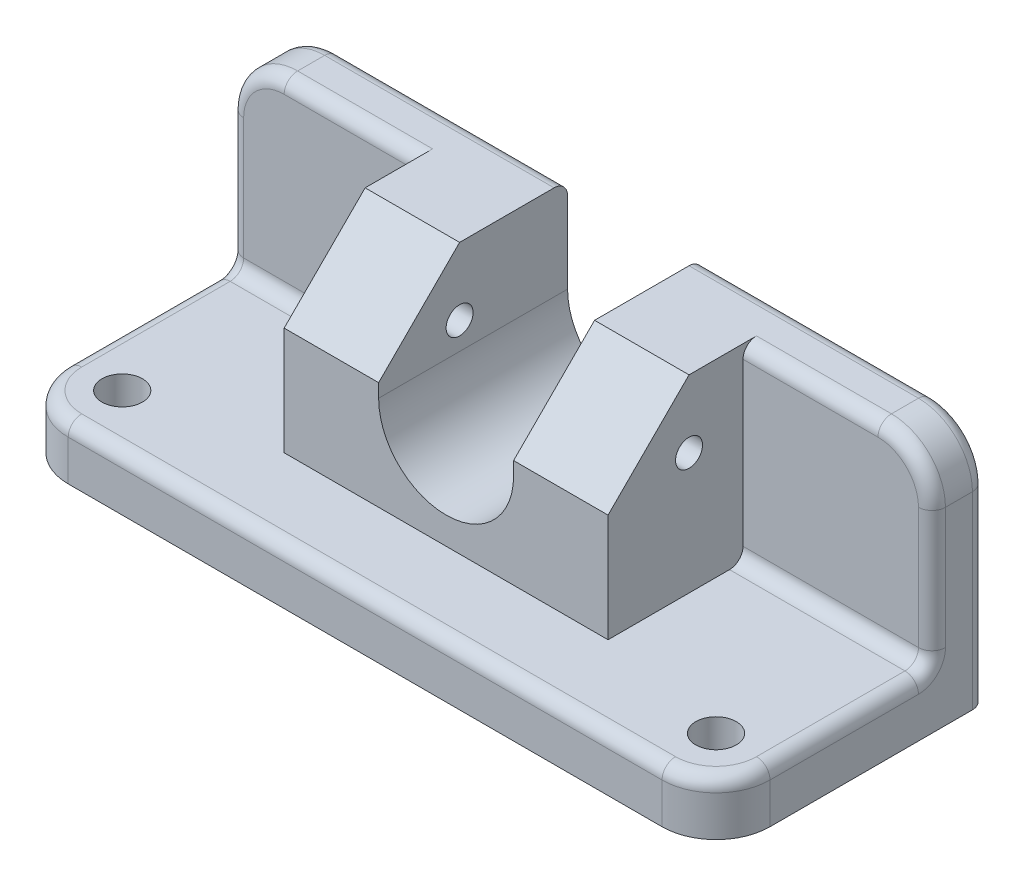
ISO-10303-21;
HEADER;
FILE_DESCRIPTION(('STEP AP214'),'2;1');
FILE_NAME('part.step','',(''),(''),'','','');
FILE_SCHEMA(('AUTOMOTIVE_DESIGN { 1 0 10303 214 1 1 1 1 }'));
ENDSEC;
DATA;
#1=APPLICATION_CONTEXT('core data for automotive mechanical design processes');
#2=APPLICATION_PROTOCOL_DEFINITION('international standard','automotive_design',2000,#1);
#3=PRODUCT_CONTEXT('',#1,'mechanical');
#4=PRODUCT('Part','Part','',(#3));
#5=PRODUCT_RELATED_PRODUCT_CATEGORY('part','',(#4));
#6=PRODUCT_DEFINITION_FORMATION('','',#4);
#7=PRODUCT_DEFINITION_CONTEXT('part definition',#1,'design');
#8=PRODUCT_DEFINITION('design','',#6,#7);
#9=PRODUCT_DEFINITION_SHAPE('','',#8);
#10=(LENGTH_UNIT() NAMED_UNIT(*) SI_UNIT(.MILLI.,.METRE.));
#11=(NAMED_UNIT(*) PLANE_ANGLE_UNIT() SI_UNIT($,.RADIAN.));
#12=(NAMED_UNIT(*) SI_UNIT($,.STERADIAN.) SOLID_ANGLE_UNIT());
#13=UNCERTAINTY_MEASURE_WITH_UNIT(LENGTH_MEASURE(1.E-05),#10,'distance_accuracy_value','');
#14=(GEOMETRIC_REPRESENTATION_CONTEXT(3) GLOBAL_UNCERTAINTY_ASSIGNED_CONTEXT((#13)) GLOBAL_UNIT_ASSIGNED_CONTEXT((#10,
#11,#12)) REPRESENTATION_CONTEXT('',''));
#15=CARTESIAN_POINT('',(0.,0.,0.));
#16=DIRECTION('',(0.,0.,1.));
#17=DIRECTION('',(1.,0.,0.));
#18=AXIS2_PLACEMENT_3D('',#15,#16,#17);
#19=CARTESIAN_POINT('',(0.,20.,0.));
#20=DIRECTION('',(0.,-1.,0.));
#21=DIRECTION('',(0.,0.,-1.));
#22=AXIS2_PLACEMENT_3D('',#19,#20,#21);
#23=PLANE('',#22);
#24=CARTESIAN_POINT('',(-44.9999999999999,20.,30.));
#25=DIRECTION('',(0.,1.,0.));
#26=DIRECTION('',(0.,0.,1.));
#27=AXIS2_PLACEMENT_3D('',#24,#25,#26);
#28=CIRCLE('',#27,7.49999999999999);
#29=CARTESIAN_POINT('',(-44.9999999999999,20.,37.5));
#30=VERTEX_POINT('',#29);
#31=EDGE_CURVE('E414',#30,#30,#28,.T.);
#32=ORIENTED_EDGE('',*,*,#31,.F.);
#33=EDGE_LOOP('',(#32));
#34=FACE_BOUND('',#33,.T.);
#35=DIRECTION('',(0.,0.,-1.));
#36=VECTOR('',#35,1.);
#37=CARTESIAN_POINT('',(4.99999999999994,20.,20.));
#38=LINE('',#37,#36);
#39=CARTESIAN_POINT('',(4.99999999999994,20.,20.));
#40=VERTEX_POINT('',#39);
#41=CARTESIAN_POINT('',(4.99999999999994,20.,-25.));
#42=VERTEX_POINT('',#41);
#43=EDGE_CURVE('E437',#40,#42,#38,.T.);
#44=ORIENTED_EDGE('',*,*,#43,.T.);
#45=DIRECTION('',(1.,0.,0.));
#46=VECTOR('',#45,1.);
#47=CARTESIAN_POINT('',(-64.9999999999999,20.,-25.));
#48=LINE('',#47,#46);
#49=CARTESIAN_POINT('',(-59.9999999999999,20.,-25.));
#50=VERTEX_POINT('',#49);
#51=EDGE_CURVE('E493',#42,#50,#48,.F.);
#52=ORIENTED_EDGE('',*,*,#51,.T.);
#53=DIRECTION('',(0.,0.,1.));
#54=VECTOR('',#53,1.);
#55=CARTESIAN_POINT('',(-59.9999999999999,20.,0.));
#56=LINE('',#55,#54);
#57=CARTESIAN_POINT('',(-59.9999999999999,20.,30.));
#58=VERTEX_POINT('',#57);
#59=EDGE_CURVE('E491',#50,#58,#56,.T.);
#60=ORIENTED_EDGE('',*,*,#59,.T.);
#61=CARTESIAN_POINT('',(-44.9999999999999,20.,30.));
#62=DIRECTION('',(0.,-1.,0.));
#63=DIRECTION('',(0.,0.,-1.));
#64=AXIS2_PLACEMENT_3D('',#61,#62,#63);
#65=CIRCLE('',#64,15.);
#66=CARTESIAN_POINT('',(-44.9999999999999,20.,45.));
#67=VERTEX_POINT('',#66);
#68=EDGE_CURVE('E489',#58,#67,#65,.F.);
#69=ORIENTED_EDGE('',*,*,#68,.T.);
#70=DIRECTION('',(1.,0.,0.));
#71=VECTOR('',#70,1.);
#72=CARTESIAN_POINT('',(0.,20.,45.));
#73=LINE('',#72,#71);
#74=CARTESIAN_POINT('',(175.,20.,45.));
#75=VERTEX_POINT('',#74);
#76=EDGE_CURVE('E487',#67,#75,#73,.T.);
#77=ORIENTED_EDGE('',*,*,#76,.T.);
#78=CARTESIAN_POINT('',(175.,20.,30.));
#79=DIRECTION('',(0.,1.,0.));
#80=DIRECTION('',(0.,0.,-1.));
#81=AXIS2_PLACEMENT_3D('',#78,#79,#80);
#82=CIRCLE('',#81,15.);
#83=CARTESIAN_POINT('',(190.,20.,30.));
#84=VERTEX_POINT('',#83);
#85=EDGE_CURVE('E342',#84,#75,#82,.F.);
#86=ORIENTED_EDGE('',*,*,#85,.F.);
#87=DIRECTION('',(0.,0.,1.));
#88=VECTOR('',#87,1.);
#89=CARTESIAN_POINT('',(190.,20.,0.));
#90=LINE('',#89,#88);
#91=CARTESIAN_POINT('',(190.,20.,-25.));
#92=VERTEX_POINT('',#91);
#93=EDGE_CURVE('E345',#92,#84,#90,.T.);
#94=ORIENTED_EDGE('',*,*,#93,.F.);
#95=DIRECTION('',(-1.,0.,0.));
#96=VECTOR('',#95,1.);
#97=CARTESIAN_POINT('',(195.,20.,-25.));
#98=LINE('',#97,#96);
#99=CARTESIAN_POINT('',(125.,20.,-25.));
#100=VERTEX_POINT('',#99);
#101=EDGE_CURVE('E348',#100,#92,#98,.F.);
#102=ORIENTED_EDGE('',*,*,#101,.F.);
#103=DIRECTION('',(0.,0.,-1.));
#104=VECTOR('',#103,1.);
#105=CARTESIAN_POINT('',(125.,20.,20.));
#106=LINE('',#105,#104);
#107=CARTESIAN_POINT('',(125.,20.,20.));
#108=VERTEX_POINT('',#107);
#109=EDGE_CURVE('E292',#108,#100,#106,.T.);
#110=ORIENTED_EDGE('',*,*,#109,.F.);
#111=DIRECTION('',(1.,0.,0.));
#112=VECTOR('',#111,1.);
#113=CARTESIAN_POINT('',(64.9999999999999,20.,20.));
#114=LINE('',#113,#112);
#115=EDGE_CURVE('E435',#40,#108,#114,.T.);
#116=ORIENTED_EDGE('',*,*,#115,.F.);
#117=EDGE_LOOP('',(#44,#52,#60,#69,#77,#86,#94,#102,#110,#116));
#118=FACE_BOUND('',#117,.T.);
#119=CARTESIAN_POINT('',(175.,20.,30.));
#120=DIRECTION('',(0.,-1.,0.));
#121=DIRECTION('',(0.,0.,1.));
#122=AXIS2_PLACEMENT_3D('',#119,#120,#121);
#123=CIRCLE('',#122,7.49999999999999);
#124=CARTESIAN_POINT('',(175.,20.,37.5));
#125=VERTEX_POINT('',#124);
#126=EDGE_CURVE('E410',#125,#125,#123,.T.);
#127=ORIENTED_EDGE('',*,*,#126,.T.);
#128=EDGE_LOOP('',(#127));
#129=FACE_BOUND('',#128,.T.);
#130=ADVANCED_FACE('F34',(#34,#118,#129),#23,.F.);
#131=CARTESIAN_POINT('',(-64.9999999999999,90.,-30.));
#132=DIRECTION('',(0.,0.,-1.));
#133=DIRECTION('',(-1.,0.,0.));
#134=AXIS2_PLACEMENT_3D('',#131,#132,#133);
#135=PLANE('',#134);
#136=DIRECTION('',(0.,-1.,0.));
#137=VECTOR('',#136,1.);
#138=CARTESIAN_POINT('',(-59.9999999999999,90.,-30.));
#139=LINE('',#138,#137);
#140=CARTESIAN_POINT('',(-59.9999999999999,70.,-30.));
#141=VERTEX_POINT('',#140);
#142=CARTESIAN_POINT('',(-59.9999999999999,25.,-30.));
#143=VERTEX_POINT('',#142);
#144=EDGE_CURVE('E480',#141,#143,#139,.T.);
#145=ORIENTED_EDGE('',*,*,#144,.T.);
#146=DIRECTION('',(1.,0.,0.));
#147=VECTOR('',#146,1.);
#148=CARTESIAN_POINT('',(4.99999999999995,25.,-30.));
#149=LINE('',#148,#147);
#150=CARTESIAN_POINT('',(4.99999999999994,25.,-30.));
#151=VERTEX_POINT('',#150);
#152=EDGE_CURVE('E482',#143,#151,#149,.T.);
#153=ORIENTED_EDGE('',*,*,#152,.T.);
#154=DIRECTION('',(0.,-1.,0.));
#155=VECTOR('',#154,1.);
#156=CARTESIAN_POINT('',(4.99999999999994,20.,-30.));
#157=LINE('',#156,#155);
#158=CARTESIAN_POINT('',(4.99999999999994,85.,-30.));
#159=VERTEX_POINT('',#158);
#160=EDGE_CURVE('E431',#159,#151,#157,.T.);
#161=ORIENTED_EDGE('',*,*,#160,.F.);
#162=DIRECTION('',(1.,0.,0.));
#163=VECTOR('',#162,1.);
#164=CARTESIAN_POINT('',(-44.9999999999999,85.,-30.));
#165=LINE('',#164,#163);
#166=CARTESIAN_POINT('',(-44.9999999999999,85.,-30.));
#167=VERTEX_POINT('',#166);
#168=EDGE_CURVE('E478',#159,#167,#165,.F.);
#169=ORIENTED_EDGE('',*,*,#168,.T.);
#170=CARTESIAN_POINT('',(-44.9999999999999,70.,-30.));
#171=DIRECTION('',(0.,0.,-1.));
#172=DIRECTION('',(-1.,0.,0.));
#173=AXIS2_PLACEMENT_3D('',#170,#171,#172);
#174=CIRCLE('',#173,15.);
#175=EDGE_CURVE('E474',#167,#141,#174,.F.);
#176=ORIENTED_EDGE('',*,*,#175,.T.);
#177=EDGE_LOOP('',(#145,#153,#161,#169,#176));
#178=FACE_BOUND('',#177,.T.);
#179=ADVANCED_FACE('F607',(#178),#135,.F.);
#180=CARTESIAN_POINT('',(-64.9999999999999,20.,-50.));
#181=DIRECTION('',(0.,0.,1.));
#182=DIRECTION('',(1.,0.,0.));
#183=AXIS2_PLACEMENT_3D('',#180,#181,#182);
#184=PLANE('',#183);
#185=CARTESIAN_POINT('',(-44.9999999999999,70.,-50.));
#186=DIRECTION('',(0.,0.,1.));
#187=DIRECTION('',(1.,0.,0.));
#188=AXIS2_PLACEMENT_3D('',#185,#186,#187);
#189=CIRCLE('',#188,15.);
#190=CARTESIAN_POINT('',(-59.9999999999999,70.,-50.));
#191=VERTEX_POINT('',#190);
#192=CARTESIAN_POINT('',(-44.9999999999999,85.,-50.));
#193=VERTEX_POINT('',#192);
#194=EDGE_CURVE('E499',#191,#193,#189,.F.);
#195=ORIENTED_EDGE('',*,*,#194,.T.);
#196=DIRECTION('',(-1.,0.,0.));
#197=VECTOR('',#196,1.);
#198=CARTESIAN_POINT('',(39.9999999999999,85.,-50.));
#199=LINE('',#198,#197);
#200=CARTESIAN_POINT('',(39.9999999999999,85.,-50.));
#201=VERTEX_POINT('',#200);
#202=EDGE_CURVE('E501',#193,#201,#199,.F.);
#203=ORIENTED_EDGE('',*,*,#202,.T.);
#204=DIRECTION('',(0.,-1.,0.));
#205=VECTOR('',#204,1.);
#206=CARTESIAN_POINT('',(39.9999999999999,90.,-50.));
#207=LINE('',#206,#205);
#208=CARTESIAN_POINT('',(40.,55.,-50.));
#209=VERTEX_POINT('',#208);
#210=EDGE_CURVE('E258',#201,#209,#207,.T.);
#211=ORIENTED_EDGE('',*,*,#210,.T.);
#212=CARTESIAN_POINT('',(64.9999999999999,55.,-50.));
#213=DIRECTION('',(0.,0.,1.));
#214=DIRECTION('',(1.,0.,0.));
#215=AXIS2_PLACEMENT_3D('',#212,#213,#214);
#216=CIRCLE('',#215,25.);
#217=CARTESIAN_POINT('',(89.9999999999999,55.,-50.));
#218=VERTEX_POINT('',#217);
#219=EDGE_CURVE('E251',#209,#218,#216,.T.);
#220=ORIENTED_EDGE('',*,*,#219,.T.);
#221=DIRECTION('',(0.,-1.,0.));
#222=VECTOR('',#221,1.);
#223=CARTESIAN_POINT('',(90.,90.,-50.));
#224=LINE('',#223,#222);
#225=CARTESIAN_POINT('',(90.,85.,-50.));
#226=VERTEX_POINT('',#225);
#227=EDGE_CURVE('E257',#226,#218,#224,.T.);
#228=ORIENTED_EDGE('',*,*,#227,.F.);
#229=DIRECTION('',(1.,0.,0.));
#230=VECTOR('',#229,1.);
#231=CARTESIAN_POINT('',(90.,85.,-50.));
#232=LINE('',#231,#230);
#233=CARTESIAN_POINT('',(175.,85.,-50.));
#234=VERTEX_POINT('',#233);
#235=EDGE_CURVE('E360',#234,#226,#232,.F.);
#236=ORIENTED_EDGE('',*,*,#235,.F.);
#237=CARTESIAN_POINT('',(175.,70.,-50.));
#238=DIRECTION('',(0.,0.,-1.));
#239=DIRECTION('',(-1.,0.,0.));
#240=AXIS2_PLACEMENT_3D('',#237,#238,#239);
#241=CIRCLE('',#240,15.);
#242=CARTESIAN_POINT('',(190.,70.,-50.));
#243=VERTEX_POINT('',#242);
#244=EDGE_CURVE('E357',#243,#234,#241,.F.);
#245=ORIENTED_EDGE('',*,*,#244,.F.);
#246=DIRECTION('',(0.,-1.,0.));
#247=VECTOR('',#246,1.);
#248=CARTESIAN_POINT('',(190.,20.,-50.));
#249=LINE('',#248,#247);
#250=CARTESIAN_POINT('',(190.,0.,-50.));
#251=VERTEX_POINT('',#250);
#252=EDGE_CURVE('E354',#251,#243,#249,.F.);
#253=ORIENTED_EDGE('',*,*,#252,.F.);
#254=DIRECTION('',(-1.,0.,0.));
#255=VECTOR('',#254,1.);
#256=CARTESIAN_POINT('',(-64.9999999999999,0.,-50.));
#257=LINE('',#256,#255);
#258=CARTESIAN_POINT('',(-59.9999999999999,0.,-50.));
#259=VERTEX_POINT('',#258);
#260=EDGE_CURVE('E443',#251,#259,#257,.T.);
#261=ORIENTED_EDGE('',*,*,#260,.T.);
#262=DIRECTION('',(0.,-1.,0.));
#263=VECTOR('',#262,1.);
#264=CARTESIAN_POINT('',(-59.9999999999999,20.,-50.));
#265=LINE('',#264,#263);
#266=EDGE_CURVE('E497',#259,#191,#265,.F.);
#267=ORIENTED_EDGE('',*,*,#266,.T.);
#268=EDGE_LOOP('',(#195,#203,#211,#220,#228,#236,#245,#253,#261,#267));
#269=FACE_BOUND('',#268,.T.);
#270=ADVANCED_FACE('F254',(#269),#184,.F.);
#271=CARTESIAN_POINT('',(-64.9999999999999,20.,50.));
#272=DIRECTION('',(1.,0.,0.));
#273=DIRECTION('',(0.,0.,-1.));
#274=AXIS2_PLACEMENT_3D('',#271,#272,#273);
#275=PLANE('',#274);
#276=CARTESIAN_POINT('',(-64.9999999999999,25.,-25.));
#277=DIRECTION('',(1.,0.,0.));
#278=DIRECTION('',(0.,0.,-1.));
#279=AXIS2_PLACEMENT_3D('',#276,#277,#278);
#280=CIRCLE('',#279,10.);
#281=CARTESIAN_POINT('',(-64.9999999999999,25.,-35.));
#282=VERTEX_POINT('',#281);
#283=CARTESIAN_POINT('',(-64.9999999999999,15.,-25.));
#284=VERTEX_POINT('',#283);
#285=EDGE_CURVE('E509',#282,#284,#280,.F.);
#286=ORIENTED_EDGE('',*,*,#285,.F.);
#287=DIRECTION('',(0.,-1.,0.));
#288=VECTOR('',#287,1.);
#289=CARTESIAN_POINT('',(-64.9999999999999,20.,-35.));
#290=LINE('',#289,#288);
#291=CARTESIAN_POINT('',(-64.9999999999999,70.,-35.));
#292=VERTEX_POINT('',#291);
#293=EDGE_CURVE('E514',#282,#292,#290,.F.);
#294=ORIENTED_EDGE('',*,*,#293,.T.);
#295=DIRECTION('',(0.,0.,1.));
#296=VECTOR('',#295,1.);
#297=CARTESIAN_POINT('',(-64.9999999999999,70.,-50.));
#298=LINE('',#297,#296);
#299=CARTESIAN_POINT('',(-64.9999999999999,70.,-45.));
#300=VERTEX_POINT('',#299);
#301=EDGE_CURVE('E456',#292,#300,#298,.F.);
#302=ORIENTED_EDGE('',*,*,#301,.T.);
#303=DIRECTION('',(0.,-1.,0.));
#304=VECTOR('',#303,1.);
#305=CARTESIAN_POINT('',(-64.9999999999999,20.,-45.));
#306=LINE('',#305,#304);
#307=CARTESIAN_POINT('',(-64.9999999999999,0.,-45.));
#308=VERTEX_POINT('',#307);
#309=EDGE_CURVE('E507',#300,#308,#306,.T.);
#310=ORIENTED_EDGE('',*,*,#309,.T.);
#311=DIRECTION('',(0.,0.,1.));
#312=VECTOR('',#311,1.);
#313=CARTESIAN_POINT('',(-64.9999999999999,0.,50.));
#314=LINE('',#313,#312);
#315=CARTESIAN_POINT('',(-64.9999999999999,0.,30.));
#316=VERTEX_POINT('',#315);
#317=EDGE_CURVE('E446',#308,#316,#314,.T.);
#318=ORIENTED_EDGE('',*,*,#317,.T.);
#319=DIRECTION('',(0.,-1.,0.));
#320=VECTOR('',#319,1.);
#321=CARTESIAN_POINT('',(-64.9999999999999,20.,30.));
#322=LINE('',#321,#320);
#323=CARTESIAN_POINT('',(-64.9999999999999,15.,30.));
#324=VERTEX_POINT('',#323);
#325=EDGE_CURVE('E453',#316,#324,#322,.F.);
#326=ORIENTED_EDGE('',*,*,#325,.T.);
#327=DIRECTION('',(0.,0.,1.));
#328=VECTOR('',#327,1.);
#329=CARTESIAN_POINT('',(-64.9999999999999,15.,50.));
#330=LINE('',#329,#328);
#331=EDGE_CURVE('E512',#324,#284,#330,.F.);
#332=ORIENTED_EDGE('',*,*,#331,.T.);
#333=EDGE_LOOP('',(#286,#294,#302,#310,#318,#326,#332));
#334=FACE_BOUND('',#333,.T.);
#335=ADVANCED_FACE('F557',(#334),#275,.F.);
#336=CARTESIAN_POINT('',(-64.9999999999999,20.,50.));
#337=DIRECTION('',(0.,0.,-1.));
#338=DIRECTION('',(-1.,0.,0.));
#339=AXIS2_PLACEMENT_3D('',#336,#337,#338);
#340=PLANE('',#339);
#341=DIRECTION('',(1.,0.,0.));
#342=VECTOR('',#341,1.);
#343=CARTESIAN_POINT('',(-64.9999999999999,0.,50.));
#344=LINE('',#343,#342);
#345=CARTESIAN_POINT('',(-44.9999999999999,0.,50.));
#346=VERTEX_POINT('',#345);
#347=CARTESIAN_POINT('',(175.,0.,50.));
#348=VERTEX_POINT('',#347);
#349=EDGE_CURVE('E448',#346,#348,#344,.T.);
#350=ORIENTED_EDGE('',*,*,#349,.T.);
#351=DIRECTION('',(0.,-1.,0.));
#352=VECTOR('',#351,1.);
#353=CARTESIAN_POINT('',(175.,20.,50.));
#354=LINE('',#353,#352);
#355=CARTESIAN_POINT('',(175.,15.,50.));
#356=VERTEX_POINT('',#355);
#357=EDGE_CURVE('E312',#356,#348,#354,.T.);
#358=ORIENTED_EDGE('',*,*,#357,.F.);
#359=DIRECTION('',(1.,0.,0.));
#360=VECTOR('',#359,1.);
#361=CARTESIAN_POINT('',(-64.9999999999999,15.,50.));
#362=LINE('',#361,#360);
#363=CARTESIAN_POINT('',(-44.9999999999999,15.,50.));
#364=VERTEX_POINT('',#363);
#365=EDGE_CURVE('E43',#356,#364,#362,.F.);
#366=ORIENTED_EDGE('',*,*,#365,.T.);
#367=DIRECTION('',(0.,-1.,0.));
#368=VECTOR('',#367,1.);
#369=CARTESIAN_POINT('',(-44.9999999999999,20.,50.));
#370=LINE('',#369,#368);
#371=EDGE_CURVE('E459',#364,#346,#370,.T.);
#372=ORIENTED_EDGE('',*,*,#371,.T.);
#373=EDGE_LOOP('',(#350,#358,#366,#372));
#374=FACE_BOUND('',#373,.T.);
#375=ADVANCED_FACE('F658',(#374),#340,.F.);
#376=CARTESIAN_POINT('',(0.,0.,0.));
#377=DIRECTION('',(0.,-1.,0.));
#378=DIRECTION('',(0.,0.,-1.));
#379=AXIS2_PLACEMENT_3D('',#376,#377,#378);
#380=PLANE('',#379);
#381=CARTESIAN_POINT('',(-44.9999999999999,0.,30.));
#382=DIRECTION('',(0.,1.,0.));
#383=DIRECTION('',(0.,0.,1.));
#384=AXIS2_PLACEMENT_3D('',#381,#382,#383);
#385=CIRCLE('',#384,7.5);
#386=CARTESIAN_POINT('',(-44.9999999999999,0.,37.5));
#387=VERTEX_POINT('',#386);
#388=EDGE_CURVE('E417',#387,#387,#385,.T.);
#389=ORIENTED_EDGE('',*,*,#388,.T.);
#390=EDGE_LOOP('',(#389));
#391=FACE_BOUND('',#390,.T.);
#392=ORIENTED_EDGE('',*,*,#317,.F.);
#393=CARTESIAN_POINT('',(-59.9999999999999,0.,-45.));
#394=DIRECTION('',(0.,-1.,0.));
#395=DIRECTION('',(0.,0.,-1.));
#396=AXIS2_PLACEMENT_3D('',#393,#394,#395);
#397=CIRCLE('',#396,5.);
#398=EDGE_CURVE('E521',#308,#259,#397,.T.);
#399=ORIENTED_EDGE('',*,*,#398,.T.);
#400=ORIENTED_EDGE('',*,*,#260,.F.);
#401=CARTESIAN_POINT('',(190.,0.,-45.));
#402=DIRECTION('',(0.,1.,0.));
#403=DIRECTION('',(0.,0.,-1.));
#404=AXIS2_PLACEMENT_3D('',#401,#402,#403);
#405=CIRCLE('',#404,5.);
#406=CARTESIAN_POINT('',(195.,0.,-45.));
#407=VERTEX_POINT('',#406);
#408=EDGE_CURVE('E387',#407,#251,#405,.T.);
#409=ORIENTED_EDGE('',*,*,#408,.F.);
#410=DIRECTION('',(0.,0.,1.));
#411=VECTOR('',#410,1.);
#412=CARTESIAN_POINT('',(195.,0.,50.));
#413=LINE('',#412,#411);
#414=CARTESIAN_POINT('',(195.,0.,30.));
#415=VERTEX_POINT('',#414);
#416=EDGE_CURVE('E300',#407,#415,#413,.T.);
#417=ORIENTED_EDGE('',*,*,#416,.T.);
#418=CARTESIAN_POINT('',(175.,0.,30.));
#419=DIRECTION('',(0.,1.,0.));
#420=DIRECTION('',(0.,0.,-1.));
#421=AXIS2_PLACEMENT_3D('',#418,#419,#420);
#422=CIRCLE('',#421,20.);
#423=EDGE_CURVE('E315',#348,#415,#422,.T.);
#424=ORIENTED_EDGE('',*,*,#423,.F.);
#425=ORIENTED_EDGE('',*,*,#349,.F.);
#426=CARTESIAN_POINT('',(-44.9999999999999,0.,30.));
#427=DIRECTION('',(0.,-1.,0.));
#428=DIRECTION('',(0.,0.,-1.));
#429=AXIS2_PLACEMENT_3D('',#426,#427,#428);
#430=CIRCLE('',#429,20.);
#431=EDGE_CURVE('E461',#346,#316,#430,.T.);
#432=ORIENTED_EDGE('',*,*,#431,.T.);
#433=EDGE_LOOP('',(#392,#399,#400,#409,#417,#424,#425,#432));
#434=FACE_BOUND('',#433,.T.);
#435=CARTESIAN_POINT('',(175.,0.,30.));
#436=DIRECTION('',(0.,-1.,0.));
#437=DIRECTION('',(0.,0.,1.));
#438=AXIS2_PLACEMENT_3D('',#435,#436,#437);
#439=CIRCLE('',#438,7.5);
#440=CARTESIAN_POINT('',(175.,0.,37.5));
#441=VERTEX_POINT('',#440);
#442=EDGE_CURVE('E1172',#441,#441,#439,.T.);
#443=ORIENTED_EDGE('',*,*,#442,.F.);
#444=EDGE_LOOP('',(#443));
#445=FACE_BOUND('',#444,.T.);
#446=ADVANCED_FACE('F560',(#391,#434,#445),#380,.T.);
#447=CARTESIAN_POINT('',(0.,90.,0.));
#448=DIRECTION('',(0.,1.,0.));
#449=DIRECTION('',(0.,0.,1.));
#450=AXIS2_PLACEMENT_3D('',#447,#448,#449);
#451=PLANE('',#450);
#452=DIRECTION('',(0.,0.,1.));
#453=VECTOR('',#452,1.);
#454=CARTESIAN_POINT('',(-44.9999999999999,90.,-30.));
#455=LINE('',#454,#453);
#456=CARTESIAN_POINT('',(-44.9999999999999,90.,-45.));
#457=VERTEX_POINT('',#456);
#458=CARTESIAN_POINT('',(-44.9999999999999,90.,-35.));
#459=VERTEX_POINT('',#458);
#460=EDGE_CURVE('E450',#457,#459,#455,.T.);
#461=ORIENTED_EDGE('',*,*,#460,.T.);
#462=DIRECTION('',(1.,0.,0.));
#463=VECTOR('',#462,1.);
#464=CARTESIAN_POINT('',(4.99999999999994,90.,-35.));
#465=LINE('',#464,#463);
#466=CARTESIAN_POINT('',(4.99999999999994,90.,-35.));
#467=VERTEX_POINT('',#466);
#468=EDGE_CURVE('E518',#459,#467,#465,.T.);
#469=ORIENTED_EDGE('',*,*,#468,.T.);
#470=DIRECTION('',(0.,0.,-1.));
#471=VECTOR('',#470,1.);
#472=CARTESIAN_POINT('',(4.99999999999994,90.,20.));
#473=LINE('',#472,#471);
#474=CARTESIAN_POINT('',(4.99999999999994,90.,-10.0000000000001));
#475=VERTEX_POINT('',#474);
#476=EDGE_CURVE('E50',#475,#467,#473,.T.);
#477=ORIENTED_EDGE('',*,*,#476,.F.);
#478=DIRECTION('',(1.,0.,0.));
#479=VECTOR('',#478,1.);
#480=CARTESIAN_POINT('',(0.,90.,-10.0000000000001));
#481=LINE('',#480,#479);
#482=CARTESIAN_POINT('',(39.9999999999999,90.,-10.0000000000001));
#483=VERTEX_POINT('',#482);
#484=EDGE_CURVE('E469',#475,#483,#481,.T.);
#485=ORIENTED_EDGE('',*,*,#484,.T.);
#486=DIRECTION('',(0.,0.,1.));
#487=VECTOR('',#486,1.);
#488=CARTESIAN_POINT('',(39.9999999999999,90.,-50.));
#489=LINE('',#488,#487);
#490=CARTESIAN_POINT('',(39.9999999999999,90.,-45.));
#491=VERTEX_POINT('',#490);
#492=EDGE_CURVE('E262',#491,#483,#489,.T.);
#493=ORIENTED_EDGE('',*,*,#492,.F.);
#494=DIRECTION('',(-1.,0.,0.));
#495=VECTOR('',#494,1.);
#496=CARTESIAN_POINT('',(-44.9999999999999,90.,-45.));
#497=LINE('',#496,#495);
#498=EDGE_CURVE('E516',#491,#457,#497,.T.);
#499=ORIENTED_EDGE('',*,*,#498,.T.);
#500=EDGE_LOOP('',(#461,#469,#477,#485,#493,#499));
#501=FACE_BOUND('',#500,.T.);
#502=ADVANCED_FACE('F598',(#501),#451,.T.);
#503=CARTESIAN_POINT('',(-44.9999999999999,70.,0.));
#504=DIRECTION('',(0.,0.,-1.));
#505=DIRECTION('',(-1.,0.,0.));
#506=AXIS2_PLACEMENT_3D('',#503,#504,#505);
#507=CYLINDRICAL_SURFACE('',#506,20.);
#508=ORIENTED_EDGE('',*,*,#460,.F.);
#509=CARTESIAN_POINT('',(-44.9999999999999,70.,-45.));
#510=DIRECTION('',(0.,0.,1.));
#511=DIRECTION('',(1.,0.,0.));
#512=AXIS2_PLACEMENT_3D('',#509,#510,#511);
#513=CIRCLE('',#512,20.);
#514=EDGE_CURVE('E505',#457,#300,#513,.T.);
#515=ORIENTED_EDGE('',*,*,#514,.T.);
#516=ORIENTED_EDGE('',*,*,#301,.F.);
#517=CARTESIAN_POINT('',(-44.9999999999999,70.,-35.));
#518=DIRECTION('',(0.,0.,-1.));
#519=DIRECTION('',(-1.,0.,0.));
#520=AXIS2_PLACEMENT_3D('',#517,#518,#519);
#521=CIRCLE('',#520,20.);
#522=EDGE_CURVE('E503',#292,#459,#521,.T.);
#523=ORIENTED_EDGE('',*,*,#522,.T.);
#524=EDGE_LOOP('',(#508,#515,#516,#523));
#525=FACE_BOUND('',#524,.T.);
#526=ADVANCED_FACE('F595',(#525),#507,.T.);
#527=CARTESIAN_POINT('',(-44.9999999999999,20.,30.));
#528=DIRECTION('',(0.,-1.,0.));
#529=DIRECTION('',(0.,0.,-1.));
#530=AXIS2_PLACEMENT_3D('',#527,#528,#529);
#531=CYLINDRICAL_SURFACE('',#530,20.);
#532=ORIENTED_EDGE('',*,*,#371,.F.);
#533=CARTESIAN_POINT('',(-44.9999999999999,15.,30.));
#534=DIRECTION('',(0.,-1.,0.));
#535=DIRECTION('',(0.,0.,-1.));
#536=AXIS2_PLACEMENT_3D('',#533,#534,#535);
#537=CIRCLE('',#536,20.);
#538=EDGE_CURVE('E495',#364,#324,#537,.T.);
#539=ORIENTED_EDGE('',*,*,#538,.T.);
#540=ORIENTED_EDGE('',*,*,#325,.F.);
#541=ORIENTED_EDGE('',*,*,#431,.F.);
#542=EDGE_LOOP('',(#532,#539,#540,#541));
#543=FACE_BOUND('',#542,.T.);
#544=ADVANCED_FACE('F568',(#543),#531,.T.);
#545=CARTESIAN_POINT('',(4.99999999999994,20.,20.));
#546=DIRECTION('',(1.,0.,0.));
#547=DIRECTION('',(0.,1.,0.));
#548=AXIS2_PLACEMENT_3D('',#545,#546,#547);
#549=PLANE('',#548);
#550=CARTESIAN_POINT('',(4.99999999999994,65.,-10.));
#551=DIRECTION('',(-1.,0.,0.));
#552=DIRECTION('',(0.,0.,1.));
#553=AXIS2_PLACEMENT_3D('',#550,#551,#552);
#554=CIRCLE('',#553,4.99999999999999);
#555=CARTESIAN_POINT('',(4.99999999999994,65.,-5.00000000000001));
#556=VERTEX_POINT('',#555);
#557=EDGE_CURVE('E421',#556,#556,#554,.T.);
#558=ORIENTED_EDGE('',*,*,#557,.F.);
#559=EDGE_LOOP('',(#558));
#560=FACE_BOUND('',#559,.T.);
#561=ORIENTED_EDGE('',*,*,#160,.T.);
#562=CARTESIAN_POINT('',(4.99999999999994,25.,-25.));
#563=DIRECTION('',(1.,0.,0.));
#564=DIRECTION('',(0.,1.,0.));
#565=AXIS2_PLACEMENT_3D('',#562,#563,#564);
#566=CIRCLE('',#565,5.);
#567=EDGE_CURVE('E485',#151,#42,#566,.F.);
#568=ORIENTED_EDGE('',*,*,#567,.T.);
#569=ORIENTED_EDGE('',*,*,#43,.F.);
#570=DIRECTION('',(0.,-1.,0.));
#571=VECTOR('',#570,1.);
#572=CARTESIAN_POINT('',(4.99999999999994,20.,20.));
#573=LINE('',#572,#571);
#574=CARTESIAN_POINT('',(4.99999999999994,60.0000000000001,20.));
#575=VERTEX_POINT('',#574);
#576=EDGE_CURVE('E433',#575,#40,#573,.T.);
#577=ORIENTED_EDGE('',*,*,#576,.F.);
#578=DIRECTION('',(0.,-0.707106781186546,0.707106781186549));
#579=VECTOR('',#578,1.);
#580=CARTESIAN_POINT('',(4.99999999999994,60.,20.));
#581=LINE('',#580,#579);
#582=EDGE_CURVE('E467',#575,#475,#581,.F.);
#583=ORIENTED_EDGE('',*,*,#582,.T.);
#584=ORIENTED_EDGE('',*,*,#476,.T.);
#585=CARTESIAN_POINT('',(4.99999999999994,85.,-35.));
#586=DIRECTION('',(1.,0.,0.));
#587=DIRECTION('',(0.,1.,0.));
#588=AXIS2_PLACEMENT_3D('',#585,#586,#587);
#589=CIRCLE('',#588,5.);
#590=EDGE_CURVE('E11',#467,#159,#589,.T.);
#591=ORIENTED_EDGE('',*,*,#590,.T.);
#592=EDGE_LOOP('',(#561,#568,#569,#577,#583,#584,#591));
#593=FACE_BOUND('',#592,.T.);
#594=ADVANCED_FACE('F605',(#560,#593),#549,.F.);
#595=CARTESIAN_POINT('',(0.,0.,20.));
#596=DIRECTION('',(0.,0.,1.));
#597=DIRECTION('',(1.,0.,0.));
#598=AXIS2_PLACEMENT_3D('',#595,#596,#597);
#599=PLANE('',#598);
#600=DIRECTION('',(0.,-1.,0.));
#601=VECTOR('',#600,1.);
#602=CARTESIAN_POINT('',(39.9999999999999,90.,20.));
#603=LINE('',#602,#601);
#604=CARTESIAN_POINT('',(40.,60.,20.));
#605=VERTEX_POINT('',#604);
#606=CARTESIAN_POINT('',(40.,55.,20.));
#607=VERTEX_POINT('',#606);
#608=EDGE_CURVE('E426',#605,#607,#603,.T.);
#609=ORIENTED_EDGE('',*,*,#608,.F.);
#610=DIRECTION('',(-1.,0.,0.));
#611=VECTOR('',#610,1.);
#612=CARTESIAN_POINT('',(0.,60.,20.));
#613=LINE('',#612,#611);
#614=EDGE_CURVE('E464',#605,#575,#613,.T.);
#615=ORIENTED_EDGE('',*,*,#614,.T.);
#616=ORIENTED_EDGE('',*,*,#576,.T.);
#617=ORIENTED_EDGE('',*,*,#115,.T.);
#618=DIRECTION('',(0.,-1.,0.));
#619=VECTOR('',#618,1.);
#620=CARTESIAN_POINT('',(125.,20.,20.));
#621=LINE('',#620,#619);
#622=CARTESIAN_POINT('',(125.,60.0000000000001,20.));
#623=VERTEX_POINT('',#622);
#624=EDGE_CURVE('E289',#623,#108,#621,.T.);
#625=ORIENTED_EDGE('',*,*,#624,.F.);
#626=DIRECTION('',(1.,0.,0.));
#627=VECTOR('',#626,1.);
#628=CARTESIAN_POINT('',(130.,60.,20.));
#629=LINE('',#628,#627);
#630=CARTESIAN_POINT('',(89.9999999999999,60.,20.));
#631=VERTEX_POINT('',#630);
#632=EDGE_CURVE('E317',#631,#623,#629,.T.);
#633=ORIENTED_EDGE('',*,*,#632,.F.);
#634=DIRECTION('',(0.,-1.,0.));
#635=VECTOR('',#634,1.);
#636=CARTESIAN_POINT('',(90.,90.,20.));
#637=LINE('',#636,#635);
#638=CARTESIAN_POINT('',(89.9999999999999,55.,20.));
#639=VERTEX_POINT('',#638);
#640=EDGE_CURVE('E279',#631,#639,#637,.T.);
#641=ORIENTED_EDGE('',*,*,#640,.T.);
#642=CARTESIAN_POINT('',(64.9999999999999,55.,20.));
#643=DIRECTION('',(0.,0.,1.));
#644=DIRECTION('',(1.,0.,0.));
#645=AXIS2_PLACEMENT_3D('',#642,#643,#644);
#646=CIRCLE('',#645,25.);
#647=EDGE_CURVE('E268',#607,#639,#646,.T.);
#648=ORIENTED_EDGE('',*,*,#647,.F.);
#649=EDGE_LOOP('',(#609,#615,#616,#617,#625,#633,#641,#648));
#650=FACE_BOUND('',#649,.T.);
#651=ADVANCED_FACE('F622',(#650),#599,.T.);
#652=CARTESIAN_POINT('',(64.9999999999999,55.,-50.));
#653=DIRECTION('',(0.,0.,1.));
#654=DIRECTION('',(1.,0.,0.));
#655=AXIS2_PLACEMENT_3D('',#652,#653,#654);
#656=CYLINDRICAL_SURFACE('',#655,25.);
#657=ORIENTED_EDGE('',*,*,#647,.T.);
#658=DIRECTION('',(0.,0.,1.));
#659=VECTOR('',#658,1.);
#660=CARTESIAN_POINT('',(89.9999999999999,55.,-50.));
#661=LINE('',#660,#659);
#662=EDGE_CURVE('E265',#218,#639,#661,.T.);
#663=ORIENTED_EDGE('',*,*,#662,.F.);
#664=ORIENTED_EDGE('',*,*,#219,.F.);
#665=DIRECTION('',(0.,0.,1.));
#666=VECTOR('',#665,1.);
#667=CARTESIAN_POINT('',(40.,55.,-50.));
#668=LINE('',#667,#666);
#669=EDGE_CURVE('E429',#209,#607,#668,.T.);
#670=ORIENTED_EDGE('',*,*,#669,.T.);
#671=EDGE_LOOP('',(#657,#663,#664,#670));
#672=FACE_BOUND('',#671,.T.);
#673=ADVANCED_FACE('F266',(#672),#656,.F.);
#674=CARTESIAN_POINT('',(39.9999999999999,90.,-50.));
#675=DIRECTION('',(-1.,0.,0.));
#676=DIRECTION('',(0.,-1.,0.));
#677=AXIS2_PLACEMENT_3D('',#674,#675,#676);
#678=PLANE('',#677);
#679=CARTESIAN_POINT('',(39.9999999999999,65.,-10.));
#680=DIRECTION('',(-1.,0.,0.));
#681=DIRECTION('',(0.,-1.,0.));
#682=AXIS2_PLACEMENT_3D('',#679,#680,#681);
#683=CIRCLE('',#682,4.99999999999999);
#684=CARTESIAN_POINT('',(39.9999999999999,60.,-10.));
#685=VERTEX_POINT('',#684);
#686=EDGE_CURVE('E424',#685,#685,#683,.T.);
#687=ORIENTED_EDGE('',*,*,#686,.T.);
#688=EDGE_LOOP('',(#687));
#689=FACE_BOUND('',#688,.T.);
#690=ORIENTED_EDGE('',*,*,#210,.F.);
#691=CARTESIAN_POINT('',(39.9999999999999,85.,-45.));
#692=DIRECTION('',(-1.,0.,0.));
#693=DIRECTION('',(0.,-1.,0.));
#694=AXIS2_PLACEMENT_3D('',#691,#692,#693);
#695=CIRCLE('',#694,5.);
#696=EDGE_CURVE('E58',#201,#491,#695,.F.);
#697=ORIENTED_EDGE('',*,*,#696,.T.);
#698=ORIENTED_EDGE('',*,*,#492,.T.);
#699=DIRECTION('',(0.,0.707106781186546,-0.707106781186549));
#700=VECTOR('',#699,1.);
#701=CARTESIAN_POINT('',(40.,60.,20.));
#702=LINE('',#701,#700);
#703=EDGE_CURVE('E472',#483,#605,#702,.F.);
#704=ORIENTED_EDGE('',*,*,#703,.T.);
#705=ORIENTED_EDGE('',*,*,#608,.T.);
#706=ORIENTED_EDGE('',*,*,#669,.F.);
#707=EDGE_LOOP('',(#690,#697,#698,#704,#705,#706));
#708=FACE_BOUND('',#707,.T.);
#709=ADVANCED_FACE('F727',(#689,#708),#678,.F.);
#710=CARTESIAN_POINT('',(0.,60.,20.));
#711=DIRECTION('',(0.,-0.707106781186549,-0.707106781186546));
#712=DIRECTION('',(-1.,0.,0.));
#713=AXIS2_PLACEMENT_3D('',#710,#711,#712);
#714=PLANE('',#713);
#715=ORIENTED_EDGE('',*,*,#703,.F.);
#716=ORIENTED_EDGE('',*,*,#484,.F.);
#717=ORIENTED_EDGE('',*,*,#582,.F.);
#718=ORIENTED_EDGE('',*,*,#614,.F.);
#719=EDGE_LOOP('',(#715,#716,#717,#718));
#720=FACE_BOUND('',#719,.T.);
#721=ADVANCED_FACE('F723',(#720),#714,.F.);
#722=CARTESIAN_POINT('',(4.99999999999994,65.,-10.));
#723=DIRECTION('',(-1.,0.,0.));
#724=DIRECTION('',(0.,0.,1.));
#725=AXIS2_PLACEMENT_3D('',#722,#723,#724);
#726=CYLINDRICAL_SURFACE('',#725,4.99999999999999);
#727=ORIENTED_EDGE('',*,*,#557,.T.);
#728=EDGE_LOOP('',(#727));
#729=FACE_BOUND('',#728,.T.);
#730=ORIENTED_EDGE('',*,*,#686,.F.);
#731=EDGE_LOOP('',(#730));
#732=FACE_BOUND('',#731,.T.);
#733=ADVANCED_FACE('F726',(#729,#732),#726,.F.);
#734=CARTESIAN_POINT('',(-44.9999999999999,20.,30.));
#735=DIRECTION('',(0.,1.,0.));
#736=DIRECTION('',(0.,0.,1.));
#737=AXIS2_PLACEMENT_3D('',#734,#735,#736);
#738=CYLINDRICAL_SURFACE('',#737,7.49999999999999);
#739=ORIENTED_EDGE('',*,*,#388,.F.);
#740=EDGE_LOOP('',(#739));
#741=FACE_BOUND('',#740,.T.);
#742=ORIENTED_EDGE('',*,*,#31,.T.);
#743=EDGE_LOOP('',(#742));
#744=FACE_BOUND('',#743,.T.);
#745=ADVANCED_FACE('F745',(#741,#744),#738,.F.);
#746=CARTESIAN_POINT('',(0.,15.,45.));
#747=DIRECTION('',(1.,0.,0.));
#748=DIRECTION('',(0.,0.,-1.));
#749=AXIS2_PLACEMENT_3D('',#746,#747,#748);
#750=CYLINDRICAL_SURFACE('',#749,5.);
#751=ORIENTED_EDGE('',*,*,#365,.F.);
#752=CARTESIAN_POINT('',(175.,15.,45.));
#753=DIRECTION('',(-1.,0.,0.));
#754=DIRECTION('',(0.,0.,1.));
#755=AXIS2_PLACEMENT_3D('',#752,#753,#754);
#756=CIRCLE('',#755,5.);
#757=EDGE_CURVE('E407',#356,#75,#756,.T.);
#758=ORIENTED_EDGE('',*,*,#757,.T.);
#759=ORIENTED_EDGE('',*,*,#76,.F.);
#760=CARTESIAN_POINT('',(-44.9999999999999,15.,45.));
#761=DIRECTION('',(-1.,0.,0.));
#762=DIRECTION('',(0.,0.,1.));
#763=AXIS2_PLACEMENT_3D('',#760,#761,#762);
#764=CIRCLE('',#763,5.);
#765=EDGE_CURVE('E418',#364,#67,#764,.T.);
#766=ORIENTED_EDGE('',*,*,#765,.F.);
#767=EDGE_LOOP('',(#751,#758,#759,#766));
#768=FACE_BOUND('',#767,.T.);
#769=ADVANCED_FACE('F662',(#768),#750,.T.);
#770=CARTESIAN_POINT('',(0.,85.,-35.));
#771=DIRECTION('',(-1.,0.,0.));
#772=DIRECTION('',(0.,0.,1.));
#773=AXIS2_PLACEMENT_3D('',#770,#771,#772);
#774=CYLINDRICAL_SURFACE('',#773,5.);
#775=ORIENTED_EDGE('',*,*,#590,.F.);
#776=ORIENTED_EDGE('',*,*,#468,.F.);
#777=CARTESIAN_POINT('',(-44.9999999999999,85.,-35.));
#778=DIRECTION('',(-1.,0.,0.));
#779=DIRECTION('',(0.,0.,1.));
#780=AXIS2_PLACEMENT_3D('',#777,#778,#779);
#781=CIRCLE('',#780,5.);
#782=EDGE_CURVE('E539',#167,#459,#781,.T.);
#783=ORIENTED_EDGE('',*,*,#782,.F.);
#784=ORIENTED_EDGE('',*,*,#168,.F.);
#785=EDGE_LOOP('',(#775,#776,#783,#784));
#786=FACE_BOUND('',#785,.T.);
#787=ADVANCED_FACE('F602',(#786),#774,.T.);
#788=CARTESIAN_POINT('',(-44.9999999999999,15.,30.));
#789=DIRECTION('',(0.,-1.,0.));
#790=DIRECTION('',(0.,0.,-1.));
#791=AXIS2_PLACEMENT_3D('',#788,#789,#790);
#792=TOROIDAL_SURFACE('',#791,15.,5.);
#793=ORIENTED_EDGE('',*,*,#765,.T.);
#794=ORIENTED_EDGE('',*,*,#68,.F.);
#795=CARTESIAN_POINT('',(-59.9999999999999,15.,30.));
#796=DIRECTION('',(0.,0.,-1.));
#797=DIRECTION('',(-1.,0.,0.));
#798=AXIS2_PLACEMENT_3D('',#795,#796,#797);
#799=CIRCLE('',#798,5.);
#800=EDGE_CURVE('E536',#324,#58,#799,.T.);
#801=ORIENTED_EDGE('',*,*,#800,.F.);
#802=ORIENTED_EDGE('',*,*,#538,.F.);
#803=EDGE_LOOP('',(#793,#794,#801,#802));
#804=FACE_BOUND('',#803,.T.);
#805=ADVANCED_FACE('F575',(#804),#792,.T.);
#806=CARTESIAN_POINT('',(-44.9999999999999,70.,-35.));
#807=DIRECTION('',(0.,0.,-1.));
#808=DIRECTION('',(-1.,0.,0.));
#809=AXIS2_PLACEMENT_3D('',#806,#807,#808);
#810=TOROIDAL_SURFACE('',#809,15.,5.);
#811=ORIENTED_EDGE('',*,*,#782,.T.);
#812=ORIENTED_EDGE('',*,*,#522,.F.);
#813=CARTESIAN_POINT('',(-59.9999999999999,70.,-35.));
#814=DIRECTION('',(0.,-1.,0.));
#815=DIRECTION('',(0.,0.,-1.));
#816=AXIS2_PLACEMENT_3D('',#813,#814,#815);
#817=CIRCLE('',#816,5.);
#818=EDGE_CURVE('E533',#141,#292,#817,.T.);
#819=ORIENTED_EDGE('',*,*,#818,.F.);
#820=ORIENTED_EDGE('',*,*,#175,.F.);
#821=EDGE_LOOP('',(#811,#812,#819,#820));
#822=FACE_BOUND('',#821,.T.);
#823=ADVANCED_FACE('F591',(#822),#810,.T.);
#824=CARTESIAN_POINT('',(-59.9999999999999,15.,0.));
#825=DIRECTION('',(0.,0.,1.));
#826=DIRECTION('',(1.,0.,0.));
#827=AXIS2_PLACEMENT_3D('',#824,#825,#826);
#828=CYLINDRICAL_SURFACE('',#827,5.);
#829=ORIENTED_EDGE('',*,*,#800,.T.);
#830=ORIENTED_EDGE('',*,*,#59,.F.);
#831=CARTESIAN_POINT('',(-59.9999999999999,15.,-25.));
#832=DIRECTION('',(0.,0.,-1.));
#833=DIRECTION('',(-1.,0.,0.));
#834=AXIS2_PLACEMENT_3D('',#831,#832,#833);
#835=CIRCLE('',#834,5.);
#836=EDGE_CURVE('E530',#284,#50,#835,.T.);
#837=ORIENTED_EDGE('',*,*,#836,.F.);
#838=ORIENTED_EDGE('',*,*,#331,.F.);
#839=EDGE_LOOP('',(#829,#830,#837,#838));
#840=FACE_BOUND('',#839,.T.);
#841=ADVANCED_FACE('F578',(#840),#828,.T.);
#842=CARTESIAN_POINT('',(-59.9999999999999,90.,-35.));
#843=DIRECTION('',(0.,-1.,0.));
#844=DIRECTION('',(0.,0.,-1.));
#845=AXIS2_PLACEMENT_3D('',#842,#843,#844);
#846=CYLINDRICAL_SURFACE('',#845,5.);
#847=ORIENTED_EDGE('',*,*,#818,.T.);
#848=ORIENTED_EDGE('',*,*,#293,.F.);
#849=CARTESIAN_POINT('',(-59.9999999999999,25.,-35.));
#850=DIRECTION('',(0.,-1.,0.));
#851=DIRECTION('',(0.,0.,-1.));
#852=AXIS2_PLACEMENT_3D('',#849,#850,#851);
#853=CIRCLE('',#852,5.);
#854=EDGE_CURVE('E527',#143,#282,#853,.T.);
#855=ORIENTED_EDGE('',*,*,#854,.F.);
#856=ORIENTED_EDGE('',*,*,#144,.F.);
#857=EDGE_LOOP('',(#847,#848,#855,#856));
#858=FACE_BOUND('',#857,.T.);
#859=ADVANCED_FACE('F585',(#858),#846,.T.);
#860=CARTESIAN_POINT('',(-59.9999999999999,25.,-25.));
#861=DIRECTION('',(1.,0.,0.));
#862=DIRECTION('',(0.,0.,-1.));
#863=AXIS2_PLACEMENT_3D('',#860,#861,#862);
#864=TOROIDAL_SURFACE('',#863,10.,5.);
#865=ORIENTED_EDGE('',*,*,#285,.T.);
#866=ORIENTED_EDGE('',*,*,#836,.T.);
#867=CARTESIAN_POINT('',(-59.9999999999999,25.,-25.));
#868=DIRECTION('',(1.,0.,0.));
#869=DIRECTION('',(0.,0.,-1.));
#870=AXIS2_PLACEMENT_3D('',#867,#868,#869);
#871=CIRCLE('',#870,5.);
#872=EDGE_CURVE('E524',#143,#50,#871,.F.);
#873=ORIENTED_EDGE('',*,*,#872,.F.);
#874=ORIENTED_EDGE('',*,*,#854,.T.);
#875=EDGE_LOOP('',(#865,#866,#873,#874));
#876=FACE_BOUND('',#875,.T.);
#877=ADVANCED_FACE('F581',(#876),#864,.T.);
#878=CARTESIAN_POINT('',(-64.9999999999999,25.,-25.));
#879=DIRECTION('',(-1.,0.,0.));
#880=DIRECTION('',(0.,0.,1.));
#881=AXIS2_PLACEMENT_3D('',#878,#879,#880);
#882=CYLINDRICAL_SURFACE('',#881,5.);
#883=ORIENTED_EDGE('',*,*,#872,.T.);
#884=ORIENTED_EDGE('',*,*,#51,.F.);
#885=ORIENTED_EDGE('',*,*,#567,.F.);
#886=ORIENTED_EDGE('',*,*,#152,.F.);
#887=EDGE_LOOP('',(#883,#884,#885,#886));
#888=FACE_BOUND('',#887,.T.);
#889=ADVANCED_FACE('F610',(#888),#882,.F.);
#890=CARTESIAN_POINT('',(-59.9999999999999,20.,-45.));
#891=DIRECTION('',(0.,-1.,0.));
#892=DIRECTION('',(0.,0.,-1.));
#893=AXIS2_PLACEMENT_3D('',#890,#891,#892);
#894=CYLINDRICAL_SURFACE('',#893,5.);
#895=ORIENTED_EDGE('',*,*,#398,.F.);
#896=ORIENTED_EDGE('',*,*,#309,.F.);
#897=CARTESIAN_POINT('',(-59.9999999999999,70.,-45.));
#898=DIRECTION('',(0.,1.,0.));
#899=DIRECTION('',(0.,0.,1.));
#900=AXIS2_PLACEMENT_3D('',#897,#898,#899);
#901=CIRCLE('',#900,5.);
#902=EDGE_CURVE('E38',#191,#300,#901,.T.);
#903=ORIENTED_EDGE('',*,*,#902,.F.);
#904=ORIENTED_EDGE('',*,*,#266,.F.);
#905=EDGE_LOOP('',(#895,#896,#903,#904));
#906=FACE_BOUND('',#905,.T.);
#907=ADVANCED_FACE('F36',(#906),#894,.T.);
#908=CARTESIAN_POINT('',(0.,85.,-45.));
#909=DIRECTION('',(1.,0.,0.));
#910=DIRECTION('',(0.,0.,-1.));
#911=AXIS2_PLACEMENT_3D('',#908,#909,#910);
#912=CYLINDRICAL_SURFACE('',#911,5.);
#913=ORIENTED_EDGE('',*,*,#696,.F.);
#914=ORIENTED_EDGE('',*,*,#202,.F.);
#915=CARTESIAN_POINT('',(-44.9999999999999,85.,-45.));
#916=DIRECTION('',(-1.,0.,0.));
#917=DIRECTION('',(0.,0.,1.));
#918=AXIS2_PLACEMENT_3D('',#915,#916,#917);
#919=CIRCLE('',#918,5.);
#920=EDGE_CURVE('E392',#457,#193,#919,.T.);
#921=ORIENTED_EDGE('',*,*,#920,.F.);
#922=ORIENTED_EDGE('',*,*,#498,.F.);
#923=EDGE_LOOP('',(#913,#914,#921,#922));
#924=FACE_BOUND('',#923,.T.);
#925=ADVANCED_FACE('F747',(#924),#912,.T.);
#926=CARTESIAN_POINT('',(-44.9999999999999,70.,-45.));
#927=DIRECTION('',(0.,0.,1.));
#928=DIRECTION('',(1.,0.,0.));
#929=AXIS2_PLACEMENT_3D('',#926,#927,#928);
#930=TOROIDAL_SURFACE('',#929,15.,5.);
#931=ORIENTED_EDGE('',*,*,#902,.T.);
#932=ORIENTED_EDGE('',*,*,#514,.F.);
#933=ORIENTED_EDGE('',*,*,#920,.T.);
#934=ORIENTED_EDGE('',*,*,#194,.F.);
#935=EDGE_LOOP('',(#931,#932,#933,#934));
#936=FACE_BOUND('',#935,.T.);
#937=ADVANCED_FACE('F550',(#936),#930,.T.);
#938=CARTESIAN_POINT('',(195.,90.,-30.));
#939=DIRECTION('',(0.,0.,-1.));
#940=DIRECTION('',(1.,0.,0.));
#941=AXIS2_PLACEMENT_3D('',#938,#939,#940);
#942=PLANE('',#941);
#943=DIRECTION('',(0.,-1.,0.));
#944=VECTOR('',#943,1.);
#945=CARTESIAN_POINT('',(190.,90.,-30.));
#946=LINE('',#945,#944);
#947=CARTESIAN_POINT('',(190.,70.,-30.));
#948=VERTEX_POINT('',#947);
#949=CARTESIAN_POINT('',(190.,25.,-30.));
#950=VERTEX_POINT('',#949);
#951=EDGE_CURVE('E334',#948,#950,#946,.T.);
#952=ORIENTED_EDGE('',*,*,#951,.F.);
#953=CARTESIAN_POINT('',(175.,70.,-30.));
#954=DIRECTION('',(0.,0.,1.));
#955=DIRECTION('',(1.,0.,0.));
#956=AXIS2_PLACEMENT_3D('',#953,#954,#955);
#957=CIRCLE('',#956,15.);
#958=CARTESIAN_POINT('',(175.,85.,-30.));
#959=VERTEX_POINT('',#958);
#960=EDGE_CURVE('E326',#959,#948,#957,.F.);
#961=ORIENTED_EDGE('',*,*,#960,.F.);
#962=DIRECTION('',(-1.,0.,0.));
#963=VECTOR('',#962,1.);
#964=CARTESIAN_POINT('',(175.,85.,-30.));
#965=LINE('',#964,#963);
#966=CARTESIAN_POINT('',(125.,85.,-30.));
#967=VERTEX_POINT('',#966);
#968=EDGE_CURVE('E331',#967,#959,#965,.F.);
#969=ORIENTED_EDGE('',*,*,#968,.F.);
#970=DIRECTION('',(0.,-1.,0.));
#971=VECTOR('',#970,1.);
#972=CARTESIAN_POINT('',(125.,20.,-30.));
#973=LINE('',#972,#971);
#974=CARTESIAN_POINT('',(125.,25.,-30.));
#975=VERTEX_POINT('',#974);
#976=EDGE_CURVE('E272',#967,#975,#973,.T.);
#977=ORIENTED_EDGE('',*,*,#976,.T.);
#978=DIRECTION('',(-1.,0.,0.));
#979=VECTOR('',#978,1.);
#980=CARTESIAN_POINT('',(125.,25.,-30.));
#981=LINE('',#980,#979);
#982=EDGE_CURVE('E337',#950,#975,#981,.T.);
#983=ORIENTED_EDGE('',*,*,#982,.F.);
#984=EDGE_LOOP('',(#952,#961,#969,#977,#983));
#985=FACE_BOUND('',#984,.T.);
#986=ADVANCED_FACE('F680',(#985),#942,.F.);
#987=CARTESIAN_POINT('',(195.,20.,50.));
#988=DIRECTION('',(-1.,0.,0.));
#989=DIRECTION('',(0.,0.,-1.));
#990=AXIS2_PLACEMENT_3D('',#987,#988,#989);
#991=PLANE('',#990);
#992=CARTESIAN_POINT('',(195.,25.,-25.));
#993=DIRECTION('',(1.,0.,0.));
#994=DIRECTION('',(0.,0.,-1.));
#995=AXIS2_PLACEMENT_3D('',#992,#993,#994);
#996=CIRCLE('',#995,10.);
#997=CARTESIAN_POINT('',(195.,25.,-35.));
#998=VERTEX_POINT('',#997);
#999=CARTESIAN_POINT('',(195.,15.,-25.));
#1000=VERTEX_POINT('',#999);
#1001=EDGE_CURVE('E371',#998,#1000,#996,.F.);
#1002=ORIENTED_EDGE('',*,*,#1001,.T.);
#1003=DIRECTION('',(0.,0.,1.));
#1004=VECTOR('',#1003,1.);
#1005=CARTESIAN_POINT('',(195.,15.,50.));
#1006=LINE('',#1005,#1004);
#1007=CARTESIAN_POINT('',(195.,15.,30.));
#1008=VERTEX_POINT('',#1007);
#1009=EDGE_CURVE('E374',#1008,#1000,#1006,.F.);
#1010=ORIENTED_EDGE('',*,*,#1009,.F.);
#1011=DIRECTION('',(0.,-1.,0.));
#1012=VECTOR('',#1011,1.);
#1013=CARTESIAN_POINT('',(195.,20.,30.));
#1014=LINE('',#1013,#1012);
#1015=EDGE_CURVE('E306',#415,#1008,#1014,.F.);
#1016=ORIENTED_EDGE('',*,*,#1015,.F.);
#1017=ORIENTED_EDGE('',*,*,#416,.F.);
#1018=DIRECTION('',(0.,-1.,0.));
#1019=VECTOR('',#1018,1.);
#1020=CARTESIAN_POINT('',(195.,20.,-45.));
#1021=LINE('',#1020,#1019);
#1022=CARTESIAN_POINT('',(195.,70.,-45.));
#1023=VERTEX_POINT('',#1022);
#1024=EDGE_CURVE('E368',#1023,#407,#1021,.T.);
#1025=ORIENTED_EDGE('',*,*,#1024,.F.);
#1026=DIRECTION('',(0.,0.,1.));
#1027=VECTOR('',#1026,1.);
#1028=CARTESIAN_POINT('',(195.,70.,-50.));
#1029=LINE('',#1028,#1027);
#1030=CARTESIAN_POINT('',(195.,70.,-35.));
#1031=VERTEX_POINT('',#1030);
#1032=EDGE_CURVE('E309',#1031,#1023,#1029,.F.);
#1033=ORIENTED_EDGE('',*,*,#1032,.F.);
#1034=DIRECTION('',(0.,-1.,0.));
#1035=VECTOR('',#1034,1.);
#1036=CARTESIAN_POINT('',(195.,20.,-35.));
#1037=LINE('',#1036,#1035);
#1038=EDGE_CURVE('E377',#998,#1031,#1037,.F.);
#1039=ORIENTED_EDGE('',*,*,#1038,.F.);
#1040=EDGE_LOOP('',(#1002,#1010,#1016,#1017,#1025,#1033,#1039));
#1041=FACE_BOUND('',#1040,.T.);
#1042=ADVANCED_FACE('F651',(#1041),#991,.F.);
#1043=CARTESIAN_POINT('',(130.,90.,0.));
#1044=DIRECTION('',(0.,1.,0.));
#1045=DIRECTION('',(0.,0.,1.));
#1046=AXIS2_PLACEMENT_3D('',#1043,#1044,#1045);
#1047=PLANE('',#1046);
#1048=DIRECTION('',(0.,0.,1.));
#1049=VECTOR('',#1048,1.);
#1050=CARTESIAN_POINT('',(175.,90.,-30.));
#1051=LINE('',#1050,#1049);
#1052=CARTESIAN_POINT('',(175.,90.,-45.));
#1053=VERTEX_POINT('',#1052);
#1054=CARTESIAN_POINT('',(175.,90.,-35.));
#1055=VERTEX_POINT('',#1054);
#1056=EDGE_CURVE('E303',#1053,#1055,#1051,.T.);
#1057=ORIENTED_EDGE('',*,*,#1056,.F.);
#1058=DIRECTION('',(1.,0.,0.));
#1059=VECTOR('',#1058,1.);
#1060=CARTESIAN_POINT('',(175.,90.,-45.));
#1061=LINE('',#1060,#1059);
#1062=CARTESIAN_POINT('',(90.,90.,-45.));
#1063=VERTEX_POINT('',#1062);
#1064=EDGE_CURVE('E380',#1063,#1053,#1061,.T.);
#1065=ORIENTED_EDGE('',*,*,#1064,.F.);
#1066=DIRECTION('',(0.,0.,1.));
#1067=VECTOR('',#1066,1.);
#1068=CARTESIAN_POINT('',(90.,90.,-50.));
#1069=LINE('',#1068,#1067);
#1070=CARTESIAN_POINT('',(90.,90.,-10.0000000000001));
#1071=VERTEX_POINT('',#1070);
#1072=EDGE_CURVE('E273',#1063,#1071,#1069,.T.);
#1073=ORIENTED_EDGE('',*,*,#1072,.T.);
#1074=DIRECTION('',(-1.,0.,0.));
#1075=VECTOR('',#1074,1.);
#1076=CARTESIAN_POINT('',(130.,90.,-10.0000000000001));
#1077=LINE('',#1076,#1075);
#1078=CARTESIAN_POINT('',(125.,90.,-10.0000000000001));
#1079=VERTEX_POINT('',#1078);
#1080=EDGE_CURVE('E321',#1079,#1071,#1077,.T.);
#1081=ORIENTED_EDGE('',*,*,#1080,.F.);
#1082=DIRECTION('',(0.,0.,-1.));
#1083=VECTOR('',#1082,1.);
#1084=CARTESIAN_POINT('',(125.,90.,20.));
#1085=LINE('',#1084,#1083);
#1086=CARTESIAN_POINT('',(125.,90.,-35.));
#1087=VERTEX_POINT('',#1086);
#1088=EDGE_CURVE('E297',#1079,#1087,#1085,.T.);
#1089=ORIENTED_EDGE('',*,*,#1088,.T.);
#1090=DIRECTION('',(-1.,0.,0.));
#1091=VECTOR('',#1090,1.);
#1092=CARTESIAN_POINT('',(125.,90.,-35.));
#1093=LINE('',#1092,#1091);
#1094=EDGE_CURVE('E383',#1055,#1087,#1093,.T.);
#1095=ORIENTED_EDGE('',*,*,#1094,.F.);
#1096=EDGE_LOOP('',(#1057,#1065,#1073,#1081,#1089,#1095));
#1097=FACE_BOUND('',#1096,.T.);
#1098=ADVANCED_FACE('F635',(#1097),#1047,.T.);
#1099=CARTESIAN_POINT('',(175.,70.,0.));
#1100=DIRECTION('',(0.,0.,-1.));
#1101=DIRECTION('',(1.,0.,0.));
#1102=AXIS2_PLACEMENT_3D('',#1099,#1100,#1101);
#1103=CYLINDRICAL_SURFACE('',#1102,20.);
#1104=ORIENTED_EDGE('',*,*,#1056,.T.);
#1105=CARTESIAN_POINT('',(175.,70.,-35.));
#1106=DIRECTION('',(0.,0.,1.));
#1107=DIRECTION('',(1.,0.,0.));
#1108=AXIS2_PLACEMENT_3D('',#1105,#1106,#1107);
#1109=CIRCLE('',#1108,20.);
#1110=EDGE_CURVE('E362',#1031,#1055,#1109,.T.);
#1111=ORIENTED_EDGE('',*,*,#1110,.F.);
#1112=ORIENTED_EDGE('',*,*,#1032,.T.);
#1113=CARTESIAN_POINT('',(175.,70.,-45.));
#1114=DIRECTION('',(0.,0.,-1.));
#1115=DIRECTION('',(-1.,0.,0.));
#1116=AXIS2_PLACEMENT_3D('',#1113,#1114,#1115);
#1117=CIRCLE('',#1116,20.);
#1118=EDGE_CURVE('E365',#1053,#1023,#1117,.T.);
#1119=ORIENTED_EDGE('',*,*,#1118,.F.);
#1120=EDGE_LOOP('',(#1104,#1111,#1112,#1119));
#1121=FACE_BOUND('',#1120,.T.);
#1122=ADVANCED_FACE('F685',(#1121),#1103,.T.);
#1123=CARTESIAN_POINT('',(175.,20.,30.));
#1124=DIRECTION('',(0.,-1.,0.));
#1125=DIRECTION('',(0.,0.,-1.));
#1126=AXIS2_PLACEMENT_3D('',#1123,#1124,#1125);
#1127=CYLINDRICAL_SURFACE('',#1126,20.);
#1128=ORIENTED_EDGE('',*,*,#357,.T.);
#1129=ORIENTED_EDGE('',*,*,#423,.T.);
#1130=ORIENTED_EDGE('',*,*,#1015,.T.);
#1131=CARTESIAN_POINT('',(175.,15.,30.));
#1132=DIRECTION('',(0.,1.,0.));
#1133=DIRECTION('',(0.,0.,-1.));
#1134=AXIS2_PLACEMENT_3D('',#1131,#1132,#1133);
#1135=CIRCLE('',#1134,20.);
#1136=EDGE_CURVE('E351',#356,#1008,#1135,.T.);
#1137=ORIENTED_EDGE('',*,*,#1136,.F.);
#1138=EDGE_LOOP('',(#1128,#1129,#1130,#1137));
#1139=FACE_BOUND('',#1138,.T.);
#1140=ADVANCED_FACE('F655',(#1139),#1127,.T.);
#1141=CARTESIAN_POINT('',(125.,20.,20.));
#1142=DIRECTION('',(-1.,0.,0.));
#1143=DIRECTION('',(0.,1.,0.));
#1144=AXIS2_PLACEMENT_3D('',#1141,#1142,#1143);
#1145=PLANE('',#1144);
#1146=CARTESIAN_POINT('',(125.,65.,-10.));
#1147=DIRECTION('',(-1.,0.,0.));
#1148=DIRECTION('',(0.,0.,1.));
#1149=AXIS2_PLACEMENT_3D('',#1146,#1147,#1148);
#1150=CIRCLE('',#1149,4.99999999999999);
#1151=CARTESIAN_POINT('',(125.,65.,-5.00000000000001));
#1152=VERTEX_POINT('',#1151);
#1153=EDGE_CURVE('E286',#1152,#1152,#1150,.T.);
#1154=ORIENTED_EDGE('',*,*,#1153,.T.);
#1155=EDGE_LOOP('',(#1154));
#1156=FACE_BOUND('',#1155,.T.);
#1157=ORIENTED_EDGE('',*,*,#976,.F.);
#1158=CARTESIAN_POINT('',(125.,85.,-35.));
#1159=DIRECTION('',(1.,0.,0.));
#1160=DIRECTION('',(0.,1.,0.));
#1161=AXIS2_PLACEMENT_3D('',#1158,#1159,#1160);
#1162=CIRCLE('',#1161,5.);
#1163=EDGE_CURVE('E390',#1087,#967,#1162,.T.);
#1164=ORIENTED_EDGE('',*,*,#1163,.F.);
#1165=ORIENTED_EDGE('',*,*,#1088,.F.);
#1166=DIRECTION('',(0.,-0.707106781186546,0.707106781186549));
#1167=VECTOR('',#1166,1.);
#1168=CARTESIAN_POINT('',(125.,60.,20.));
#1169=LINE('',#1168,#1167);
#1170=EDGE_CURVE('E319',#623,#1079,#1169,.F.);
#1171=ORIENTED_EDGE('',*,*,#1170,.F.);
#1172=ORIENTED_EDGE('',*,*,#624,.T.);
#1173=ORIENTED_EDGE('',*,*,#109,.T.);
#1174=CARTESIAN_POINT('',(125.,25.,-25.));
#1175=DIRECTION('',(1.,0.,0.));
#1176=DIRECTION('',(0.,1.,0.));
#1177=AXIS2_PLACEMENT_3D('',#1174,#1175,#1176);
#1178=CIRCLE('',#1177,5.);
#1179=EDGE_CURVE('E340',#975,#100,#1178,.F.);
#1180=ORIENTED_EDGE('',*,*,#1179,.F.);
#1181=EDGE_LOOP('',(#1157,#1164,#1165,#1171,#1172,#1173,#1180));
#1182=FACE_BOUND('',#1181,.T.);
#1183=ADVANCED_FACE('F627',(#1156,#1182),#1145,.F.);
#1184=CARTESIAN_POINT('',(90.,90.,-50.));
#1185=DIRECTION('',(1.,0.,0.));
#1186=DIRECTION('',(0.,-1.,0.));
#1187=AXIS2_PLACEMENT_3D('',#1184,#1185,#1186);
#1188=PLANE('',#1187);
#1189=CARTESIAN_POINT('',(89.9999999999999,65.,-10.));
#1190=DIRECTION('',(-1.,0.,0.));
#1191=DIRECTION('',(0.,-1.,0.));
#1192=AXIS2_PLACEMENT_3D('',#1189,#1190,#1191);
#1193=CIRCLE('',#1192,4.99999999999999);
#1194=CARTESIAN_POINT('',(89.9999999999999,60.,-10.));
#1195=VERTEX_POINT('',#1194);
#1196=EDGE_CURVE('E283',#1195,#1195,#1193,.T.);
#1197=ORIENTED_EDGE('',*,*,#1196,.F.);
#1198=EDGE_LOOP('',(#1197));
#1199=FACE_BOUND('',#1198,.T.);
#1200=ORIENTED_EDGE('',*,*,#227,.T.);
#1201=ORIENTED_EDGE('',*,*,#662,.T.);
#1202=ORIENTED_EDGE('',*,*,#640,.F.);
#1203=DIRECTION('',(0.,0.707106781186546,-0.707106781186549));
#1204=VECTOR('',#1203,1.);
#1205=CARTESIAN_POINT('',(89.9999999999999,60.,20.));
#1206=LINE('',#1205,#1204);
#1207=EDGE_CURVE('E324',#1071,#631,#1206,.F.);
#1208=ORIENTED_EDGE('',*,*,#1207,.F.);
#1209=ORIENTED_EDGE('',*,*,#1072,.F.);
#1210=CARTESIAN_POINT('',(90.,85.,-45.));
#1211=DIRECTION('',(-1.,0.,0.));
#1212=DIRECTION('',(0.,-1.,0.));
#1213=AXIS2_PLACEMENT_3D('',#1210,#1211,#1212);
#1214=CIRCLE('',#1213,5.);
#1215=EDGE_CURVE('E277',#226,#1063,#1214,.F.);
#1216=ORIENTED_EDGE('',*,*,#1215,.F.);
#1217=EDGE_LOOP('',(#1200,#1201,#1202,#1208,#1209,#1216));
#1218=FACE_BOUND('',#1217,.T.);
#1219=ADVANCED_FACE('F275',(#1199,#1218),#1188,.F.);
#1220=CARTESIAN_POINT('',(130.,60.,20.));
#1221=DIRECTION('',(0.,-0.707106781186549,-0.707106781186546));
#1222=DIRECTION('',(1.,0.,0.));
#1223=AXIS2_PLACEMENT_3D('',#1220,#1221,#1222);
#1224=PLANE('',#1223);
#1225=ORIENTED_EDGE('',*,*,#1207,.T.);
#1226=ORIENTED_EDGE('',*,*,#632,.T.);
#1227=ORIENTED_EDGE('',*,*,#1170,.T.);
#1228=ORIENTED_EDGE('',*,*,#1080,.T.);
#1229=EDGE_LOOP('',(#1225,#1226,#1227,#1228));
#1230=FACE_BOUND('',#1229,.T.);
#1231=ADVANCED_FACE('F631',(#1230),#1224,.F.);
#1232=CARTESIAN_POINT('',(125.,65.,-10.));
#1233=DIRECTION('',(1.,0.,0.));
#1234=DIRECTION('',(0.,0.,1.));
#1235=AXIS2_PLACEMENT_3D('',#1232,#1233,#1234);
#1236=CYLINDRICAL_SURFACE('',#1235,4.99999999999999);
#1237=ORIENTED_EDGE('',*,*,#1153,.F.);
#1238=EDGE_LOOP('',(#1237));
#1239=FACE_BOUND('',#1238,.T.);
#1240=ORIENTED_EDGE('',*,*,#1196,.T.);
#1241=EDGE_LOOP('',(#1240));
#1242=FACE_BOUND('',#1241,.T.);
#1243=ADVANCED_FACE('F888',(#1239,#1242),#1236,.F.);
#1244=CARTESIAN_POINT('',(175.,20.,30.));
#1245=DIRECTION('',(0.,1.,0.));
#1246=DIRECTION('',(0.,0.,1.));
#1247=AXIS2_PLACEMENT_3D('',#1244,#1245,#1246);
#1248=CYLINDRICAL_SURFACE('',#1247,7.49999999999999);
#1249=ORIENTED_EDGE('',*,*,#442,.T.);
#1250=EDGE_LOOP('',(#1249));
#1251=FACE_BOUND('',#1250,.T.);
#1252=ORIENTED_EDGE('',*,*,#126,.F.);
#1253=EDGE_LOOP('',(#1252));
#1254=FACE_BOUND('',#1253,.T.);
#1255=ADVANCED_FACE('F898',(#1251,#1254),#1248,.F.);
#1256=CARTESIAN_POINT('',(130.,85.,-35.));
#1257=DIRECTION('',(1.,0.,0.));
#1258=DIRECTION('',(0.,0.,1.));
#1259=AXIS2_PLACEMENT_3D('',#1256,#1257,#1258);
#1260=CYLINDRICAL_SURFACE('',#1259,5.);
#1261=ORIENTED_EDGE('',*,*,#1163,.T.);
#1262=ORIENTED_EDGE('',*,*,#968,.T.);
#1263=CARTESIAN_POINT('',(175.,85.,-35.));
#1264=DIRECTION('',(-1.,0.,0.));
#1265=DIRECTION('',(0.,0.,1.));
#1266=AXIS2_PLACEMENT_3D('',#1263,#1264,#1265);
#1267=CIRCLE('',#1266,5.);
#1268=EDGE_CURVE('E405',#959,#1055,#1267,.T.);
#1269=ORIENTED_EDGE('',*,*,#1268,.T.);
#1270=ORIENTED_EDGE('',*,*,#1094,.T.);
#1271=EDGE_LOOP('',(#1261,#1262,#1269,#1270));
#1272=FACE_BOUND('',#1271,.T.);
#1273=ADVANCED_FACE('F682',(#1272),#1260,.T.);
#1274=CARTESIAN_POINT('',(175.,15.,30.));
#1275=DIRECTION('',(0.,-1.,0.));
#1276=DIRECTION('',(0.,0.,-1.));
#1277=AXIS2_PLACEMENT_3D('',#1274,#1275,#1276);
#1278=TOROIDAL_SURFACE('',#1277,15.,5.);
#1279=ORIENTED_EDGE('',*,*,#757,.F.);
#1280=ORIENTED_EDGE('',*,*,#1136,.T.);
#1281=CARTESIAN_POINT('',(190.,15.,30.));
#1282=DIRECTION('',(0.,0.,1.));
#1283=DIRECTION('',(1.,0.,0.));
#1284=AXIS2_PLACEMENT_3D('',#1281,#1282,#1283);
#1285=CIRCLE('',#1284,5.);
#1286=EDGE_CURVE('E403',#1008,#84,#1285,.T.);
#1287=ORIENTED_EDGE('',*,*,#1286,.T.);
#1288=ORIENTED_EDGE('',*,*,#85,.T.);
#1289=EDGE_LOOP('',(#1279,#1280,#1287,#1288));
#1290=FACE_BOUND('',#1289,.T.);
#1291=ADVANCED_FACE('F667',(#1290),#1278,.T.);
#1292=CARTESIAN_POINT('',(175.,70.,-35.));
#1293=DIRECTION('',(0.,0.,-1.));
#1294=DIRECTION('',(1.,0.,0.));
#1295=AXIS2_PLACEMENT_3D('',#1292,#1293,#1294);
#1296=TOROIDAL_SURFACE('',#1295,15.,5.);
#1297=ORIENTED_EDGE('',*,*,#1268,.F.);
#1298=ORIENTED_EDGE('',*,*,#960,.T.);
#1299=CARTESIAN_POINT('',(190.,70.,-35.));
#1300=DIRECTION('',(0.,1.,0.));
#1301=DIRECTION('',(0.,0.,-1.));
#1302=AXIS2_PLACEMENT_3D('',#1299,#1300,#1301);
#1303=CIRCLE('',#1302,5.);
#1304=EDGE_CURVE('E401',#948,#1031,#1303,.T.);
#1305=ORIENTED_EDGE('',*,*,#1304,.T.);
#1306=ORIENTED_EDGE('',*,*,#1110,.T.);
#1307=EDGE_LOOP('',(#1297,#1298,#1305,#1306));
#1308=FACE_BOUND('',#1307,.T.);
#1309=ADVANCED_FACE('F691',(#1308),#1296,.T.);
#1310=CARTESIAN_POINT('',(190.,15.,0.));
#1311=DIRECTION('',(0.,0.,1.));
#1312=DIRECTION('',(-1.,0.,0.));
#1313=AXIS2_PLACEMENT_3D('',#1310,#1311,#1312);
#1314=CYLINDRICAL_SURFACE('',#1313,5.);
#1315=ORIENTED_EDGE('',*,*,#1286,.F.);
#1316=ORIENTED_EDGE('',*,*,#1009,.T.);
#1317=CARTESIAN_POINT('',(190.,15.,-25.));
#1318=DIRECTION('',(0.,0.,1.));
#1319=DIRECTION('',(1.,0.,0.));
#1320=AXIS2_PLACEMENT_3D('',#1317,#1318,#1319);
#1321=CIRCLE('',#1320,5.);
#1322=EDGE_CURVE('E398',#1000,#92,#1321,.T.);
#1323=ORIENTED_EDGE('',*,*,#1322,.T.);
#1324=ORIENTED_EDGE('',*,*,#93,.T.);
#1325=EDGE_LOOP('',(#1315,#1316,#1323,#1324));
#1326=FACE_BOUND('',#1325,.T.);
#1327=ADVANCED_FACE('F669',(#1326),#1314,.T.);
#1328=CARTESIAN_POINT('',(190.,90.,-35.));
#1329=DIRECTION('',(0.,-1.,0.));
#1330=DIRECTION('',(0.,0.,-1.));
#1331=AXIS2_PLACEMENT_3D('',#1328,#1329,#1330);
#1332=CYLINDRICAL_SURFACE('',#1331,5.);
#1333=ORIENTED_EDGE('',*,*,#1304,.F.);
#1334=ORIENTED_EDGE('',*,*,#951,.T.);
#1335=CARTESIAN_POINT('',(190.,25.,-35.));
#1336=DIRECTION('',(0.,1.,0.));
#1337=DIRECTION('',(0.,0.,-1.));
#1338=AXIS2_PLACEMENT_3D('',#1335,#1336,#1337);
#1339=CIRCLE('',#1338,5.);
#1340=EDGE_CURVE('E395',#950,#998,#1339,.T.);
#1341=ORIENTED_EDGE('',*,*,#1340,.T.);
#1342=ORIENTED_EDGE('',*,*,#1038,.T.);
#1343=EDGE_LOOP('',(#1333,#1334,#1341,#1342));
#1344=FACE_BOUND('',#1343,.T.);
#1345=ADVANCED_FACE('F689',(#1344),#1332,.T.);
#1346=CARTESIAN_POINT('',(190.,25.,-25.));
#1347=DIRECTION('',(-1.,0.,0.));
#1348=DIRECTION('',(0.,0.,-1.));
#1349=AXIS2_PLACEMENT_3D('',#1346,#1347,#1348);
#1350=TOROIDAL_SURFACE('',#1349,10.,5.);
#1351=ORIENTED_EDGE('',*,*,#1001,.F.);
#1352=ORIENTED_EDGE('',*,*,#1340,.F.);
#1353=CARTESIAN_POINT('',(190.,25.,-25.));
#1354=DIRECTION('',(1.,0.,0.));
#1355=DIRECTION('',(0.,0.,-1.));
#1356=AXIS2_PLACEMENT_3D('',#1353,#1354,#1355);
#1357=CIRCLE('',#1356,5.);
#1358=EDGE_CURVE('E393',#950,#92,#1357,.F.);
#1359=ORIENTED_EDGE('',*,*,#1358,.T.);
#1360=ORIENTED_EDGE('',*,*,#1322,.F.);
#1361=EDGE_LOOP('',(#1351,#1352,#1359,#1360));
#1362=FACE_BOUND('',#1361,.T.);
#1363=ADVANCED_FACE('F688',(#1362),#1350,.T.);
#1364=CARTESIAN_POINT('',(195.,25.,-25.));
#1365=DIRECTION('',(1.,0.,0.));
#1366=DIRECTION('',(0.,0.,1.));
#1367=AXIS2_PLACEMENT_3D('',#1364,#1365,#1366);
#1368=CYLINDRICAL_SURFACE('',#1367,5.);
#1369=ORIENTED_EDGE('',*,*,#1358,.F.);
#1370=ORIENTED_EDGE('',*,*,#982,.T.);
#1371=ORIENTED_EDGE('',*,*,#1179,.T.);
#1372=ORIENTED_EDGE('',*,*,#101,.T.);
#1373=EDGE_LOOP('',(#1369,#1370,#1371,#1372));
#1374=FACE_BOUND('',#1373,.T.);
#1375=ADVANCED_FACE('F673',(#1374),#1368,.F.);
#1376=CARTESIAN_POINT('',(190.,20.,-45.));
#1377=DIRECTION('',(0.,-1.,0.));
#1378=DIRECTION('',(0.,0.,-1.));
#1379=AXIS2_PLACEMENT_3D('',#1376,#1377,#1378);
#1380=CYLINDRICAL_SURFACE('',#1379,5.);
#1381=ORIENTED_EDGE('',*,*,#408,.T.);
#1382=ORIENTED_EDGE('',*,*,#252,.T.);
#1383=CARTESIAN_POINT('',(190.,70.,-45.));
#1384=DIRECTION('',(0.,-1.,0.));
#1385=DIRECTION('',(0.,0.,1.));
#1386=AXIS2_PLACEMENT_3D('',#1383,#1384,#1385);
#1387=CIRCLE('',#1386,5.);
#1388=EDGE_CURVE('E396',#243,#1023,#1387,.T.);
#1389=ORIENTED_EDGE('',*,*,#1388,.T.);
#1390=ORIENTED_EDGE('',*,*,#1024,.T.);
#1391=EDGE_LOOP('',(#1381,#1382,#1389,#1390));
#1392=FACE_BOUND('',#1391,.T.);
#1393=ADVANCED_FACE('F645',(#1392),#1380,.T.);
#1394=CARTESIAN_POINT('',(130.,85.,-45.));
#1395=DIRECTION('',(-1.,0.,0.));
#1396=DIRECTION('',(0.,0.,-1.));
#1397=AXIS2_PLACEMENT_3D('',#1394,#1395,#1396);
#1398=CYLINDRICAL_SURFACE('',#1397,5.);
#1399=ORIENTED_EDGE('',*,*,#1215,.T.);
#1400=ORIENTED_EDGE('',*,*,#1064,.T.);
#1401=CARTESIAN_POINT('',(175.,85.,-45.));
#1402=DIRECTION('',(-1.,0.,0.));
#1403=DIRECTION('',(0.,0.,1.));
#1404=AXIS2_PLACEMENT_3D('',#1401,#1402,#1403);
#1405=CIRCLE('',#1404,5.);
#1406=EDGE_CURVE('E411',#1053,#234,#1405,.T.);
#1407=ORIENTED_EDGE('',*,*,#1406,.T.);
#1408=ORIENTED_EDGE('',*,*,#235,.T.);
#1409=EDGE_LOOP('',(#1399,#1400,#1407,#1408));
#1410=FACE_BOUND('',#1409,.T.);
#1411=ADVANCED_FACE('F638',(#1410),#1398,.T.);
#1412=CARTESIAN_POINT('',(175.,70.,-45.));
#1413=DIRECTION('',(0.,0.,1.));
#1414=DIRECTION('',(-1.,0.,0.));
#1415=AXIS2_PLACEMENT_3D('',#1412,#1413,#1414);
#1416=TOROIDAL_SURFACE('',#1415,15.,5.);
#1417=ORIENTED_EDGE('',*,*,#1388,.F.);
#1418=ORIENTED_EDGE('',*,*,#244,.T.);
#1419=ORIENTED_EDGE('',*,*,#1406,.F.);
#1420=ORIENTED_EDGE('',*,*,#1118,.T.);
#1421=EDGE_LOOP('',(#1417,#1418,#1419,#1420));
#1422=FACE_BOUND('',#1421,.T.);
#1423=ADVANCED_FACE('F642',(#1422),#1416,.T.);
#1424=CLOSED_SHELL('',(#130,#179,#270,#335,#375,#446,#502,#526,#544,#594,#651,#673,#709,#721,
#733,#745,#769,#787,#805,#823,#841,#859,#877,#889,#907,#925,#937,#986,#1042,#1098,#1122,#1140,
#1183,#1219,#1231,#1243,#1255,#1273,#1291,#1309,#1327,#1345,#1363,#1375,#1393,#1411,#1423));
#1425=MANIFOLD_SOLID_BREP('B2',#1424);
#1426=ADVANCED_BREP_SHAPE_REPRESENTATION('',(#18,#1425),#14);
#1427=SHAPE_DEFINITION_REPRESENTATION(#9,#1426);
ENDSEC;
END-ISO-10303-21;
